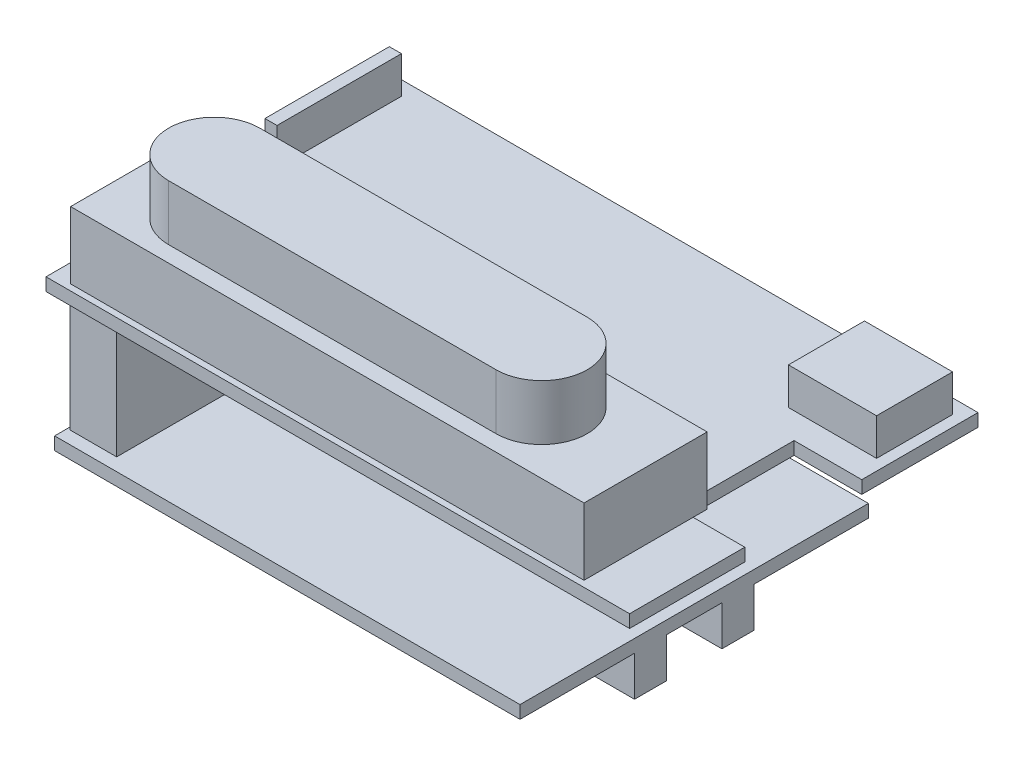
from build123d import *

# Parameters (mm, degrees)
EXTRUDE1_DEPTH = 1.3208
SKETCH2_W      = 52.959
SKETCH2_H      = 12.7
EXTRUDE2_DEPTH = 6.9088
EXTRUDE3_DEPTH = 5.715
SKETCH4_W      = 9.089457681
SKETCH4_H      = 7.841885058
SKETCH4_W_2    = 1.247572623
SKETCH4_H_2    = 12.832175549
EXTRUDE4_DEPTH = 3.81
SKETCH5_W      = 4.826
SKETCH5_H      = 17.526
EXTRUDE5_DEPTH = 12.446
EXTRUDE6_DEPTH = 1.3208
SKETCH7_W      = 15.6972
SKETCH7_H      = 3.302
EXTRUDE7_DEPTH = 4.1148


with BuildPart() as part:
    # Sketch1 → Extrude1 (new body)
    with BuildSketch(Plane(origin=(0, 0, 0), x_dir=(1, 0, 0), z_dir=(0, 1, 0))):
        Polygon((60.198, 23.9522), (53.213, 23.9522), (53.213, 11.8872), (60.198, 11.8872), (60.198, 0), (0, 0), (0, 35.941), (60.198, 35.941), align=None)
    extrude(amount=EXTRUDE1_DEPTH)

    # Sketch2 → Extrude2 (add)
    with BuildSketch(Plane(origin=(0, 1.3208, 0), x_dir=(1, 0, 0), z_dir=(0, 1, 0))):
        with Locations((28.3845, 6.985)):
            Rectangle(SKETCH2_W, SKETCH2_H)
    extrude(amount=EXTRUDE2_DEPTH)

    # Sketch3 → Extrude3 (add)
    with BuildSketch(Plane(origin=(0, 8.2296, 0), x_dir=(1, 0, 0), z_dir=(0, 1, 0))):
        with BuildLine():
            Line((10.362513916, 11.684), (44.144513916, 11.684))
            ThreePointArc((44.144513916, 11.684), (48.843513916, 6.985), (44.144513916, 2.286))
            Line((44.144513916, 2.286), (10.362513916, 2.286))
            ThreePointArc((10.362513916, 2.286), (5.663513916, 6.985), (10.362513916, 11.684))
        make_face()
    extrude(amount=EXTRUDE3_DEPTH)

    # Sketch4 → Extrude4 (add)
    with BuildSketch(Plane(origin=(0, 1.3208, 0), x_dir=(1, 0, 0), z_dir=(0, 1, 0))):
        with Locations((54.515778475, 30.535338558)):
            Rectangle(SKETCH4_W, SKETCH4_H)
        with Locations((1.583054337, 28.040193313)):
            Rectangle(SKETCH4_W_2, SKETCH4_H_2)
    extrude(amount=EXTRUDE4_DEPTH)

    # Sketch5 → Extrude5 (add)
    with BuildSketch(Plane.XZ):
        with Locations((3.556, -10.0838)):
            Rectangle(SKETCH5_W, SKETCH5_H)
    extrude(amount=EXTRUDE5_DEPTH)

    # Sketch6 → Extrude6 (add)
    with BuildSketch(Plane.XZ.offset(12.446)):
        with BuildLine():
            Line((0.889, 0), (48.895, 0))
            Line((48.895, 0), (48.895, -35.941))
            Line((48.895, -35.941), (0.889, -35.941))
            Line((0.889, -35.941), (0.889, -24.765))
            Line((0.889, -24.765), (6.604, -24.765))
            ThreePointArc((6.604, -24.765), (8.3185, -23.0505), (6.604, -21.336))
            Line((6.604, -21.336), (0.889, -21.336))
            Line((0.889, -21.336), (0.889, 0))
        make_face()
    extrude(amount=EXTRUDE6_DEPTH)

    # Sketch7 → Extrude7 (add)
    with BuildSketch(Plane.XZ.offset(13.7668)):
        with Locations((41.0464, -13.462)):
            Rectangle(SKETCH7_W, SKETCH7_H)
        with Locations((41.0464, -22.479)):
            Rectangle(SKETCH7_W, SKETCH7_H)
    extrude(amount=EXTRUDE7_DEPTH)


solid = part.part
